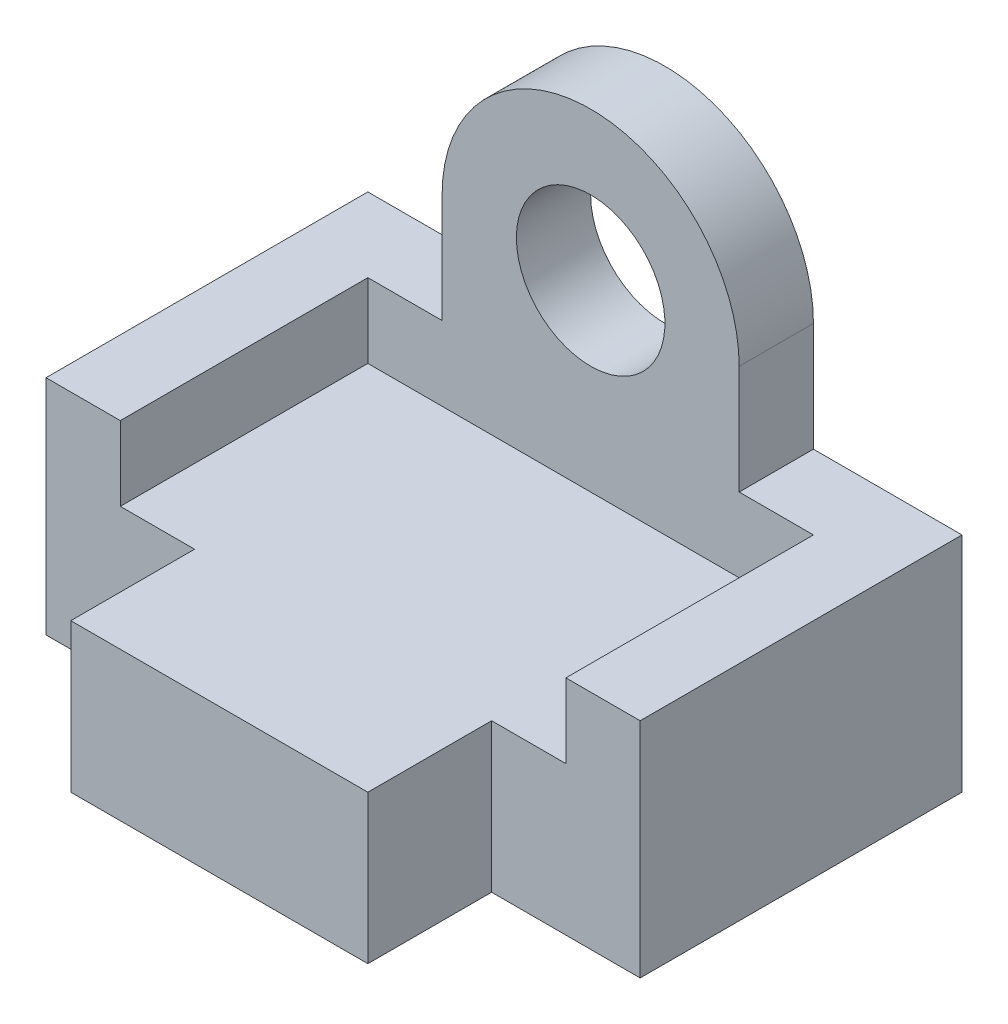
from build123d import *

# Parameters (mm, degrees)
SKETCH_1_W      = 90
SKETCH_1_H      = 50
EXTRUDE_1_DEPTH = 30
EXTRUDE_2_DEPTH = 45
SKETCH_2_W      = 60
SKETCH_2_H      = 30
EXTRUDE_3_DEPTH = 25
SKETCH_3_R      = 15
EXTRUDE_4_DEPTH = 15


with BuildPart() as part:
    # Sketch 1 → Extrude 1 (new body)
    with BuildSketch(Plane(origin=(0, 0, 0), x_dir=(1, 0, 0), z_dir=(0, 1, 0))):
        with Locations((0, -40)):
            Rectangle(SKETCH_1_W, SKETCH_1_H)
    extrude(amount=EXTRUDE_1_DEPTH)

    # Sketch 1_3 → Extrude 2 (add)
    with BuildSketch(Plane(origin=(0, 0, 0), x_dir=(1, 0, 0), z_dir=(0, 1, 0))):
        Polygon((60, 0), (-60, 0), (-60, -65), (-45, -65), (-45, -15), (45, -15), (45, -65), (60, -65), align=None)
    extrude(amount=EXTRUDE_2_DEPTH)

    # Sketch 2 → Extrude 3 (add)
    with BuildSketch(Plane.XY.offset(65)):
        with Locations((0, 15)):
            Rectangle(SKETCH_2_W, SKETCH_2_H)
    extrude(amount=EXTRUDE_3_DEPTH)

    # Sketch 3 → Extrude 4 (add)
    with BuildSketch(Plane(origin=(0, 0, 0), x_dir=(-1, 0, 0), z_dir=(0, 0, -1))):
        with BuildLine():
            Line((-30, 45), (-30, 67))
            ThreePointArc((-30, 67), (0, 97), (30, 67))
            Line((30, 67), (30, 45))
            Line((30, 45), (-30, 45))
        make_face()
        with Locations((0, 67)):
            Circle(SKETCH_3_R, mode=Mode.SUBTRACT)
    extrude(amount=-EXTRUDE_4_DEPTH)


solid = part.part
